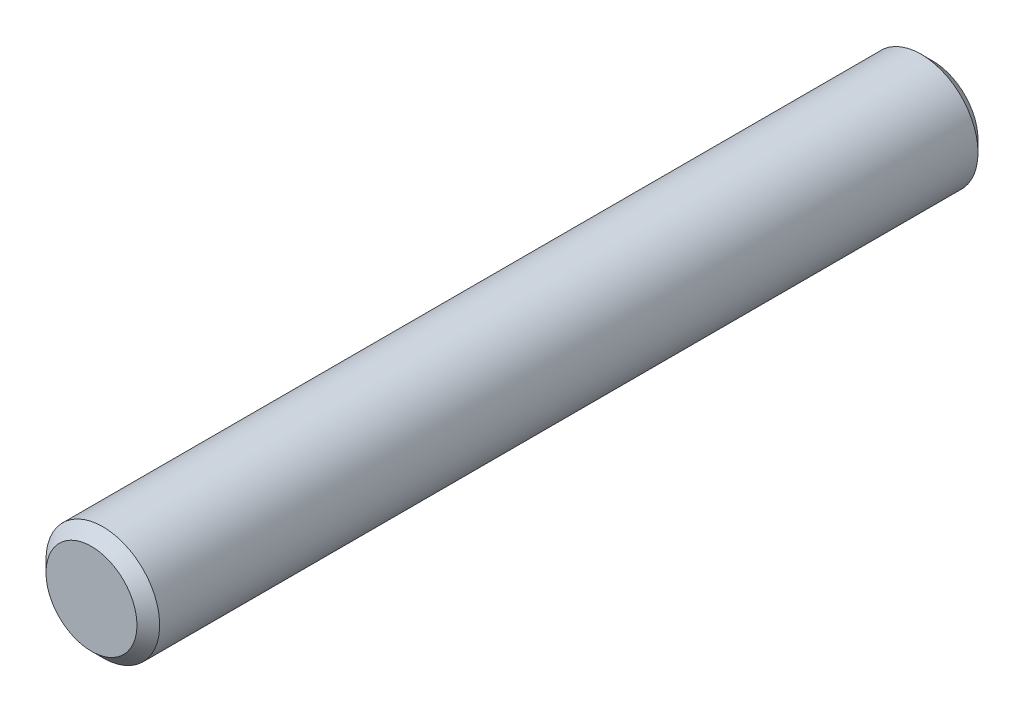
from build123d import *

# Parameters (mm, degrees)
ESQUISSE1_R          = 1.25
BASE_EXTRUSION_DEPTH = 18.5
CHANFREIN1_SIZE      = 0.25


with BuildPart() as part:
    # Esquisse1 → Base-Extrusion (new body)
    with BuildSketch(Plane.XY):
        with Locations(Location((21.389211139, -12.75, 0), (0, 0, 180))):
            Circle(ESQUISSE1_R)
    extrude(amount=BASE_EXTRUSION_DEPTH)

    # Chanfrein1
    chanfrein1_edges = [part.edges().sort_by_distance(p)[0] for p in [
        (22.639211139, -12.75, 0),
        (22.639211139, -12.75, 18.5),
    ]]
    chamfer(chanfrein1_edges, length=CHANFREIN1_SIZE)


solid = part.part
